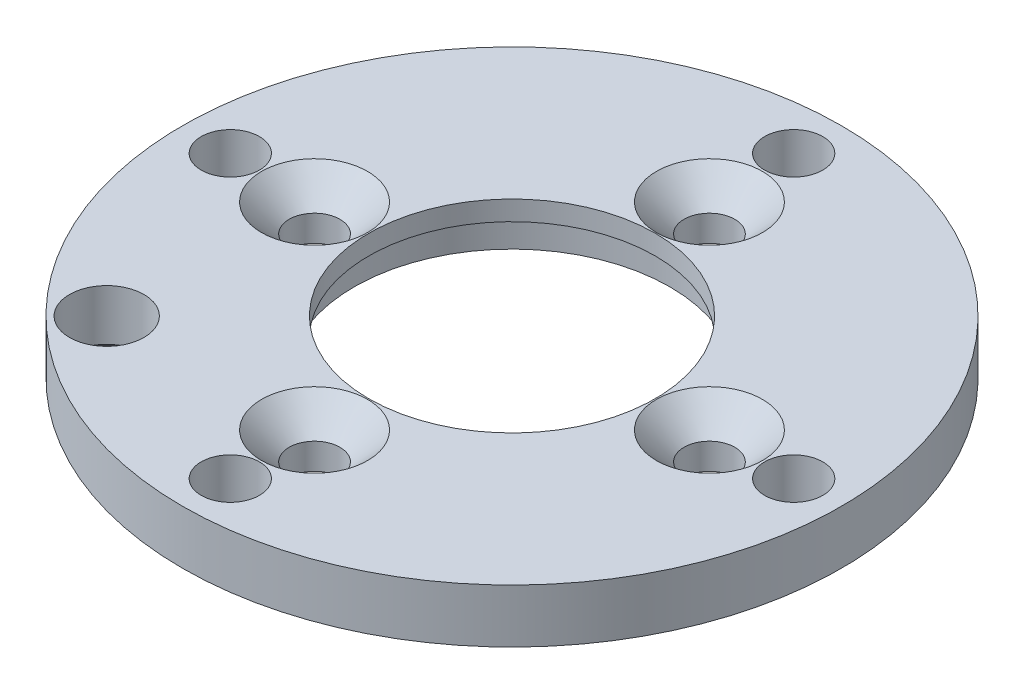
ISO-10303-21;
HEADER;
FILE_DESCRIPTION(('STEP AP214'),'2;1');
FILE_NAME('part.step','',(''),(''),'','','');
FILE_SCHEMA(('AUTOMOTIVE_DESIGN { 1 0 10303 214 1 1 1 1 }'));
ENDSEC;
DATA;
#1=APPLICATION_CONTEXT('core data for automotive mechanical design processes');
#2=APPLICATION_PROTOCOL_DEFINITION('international standard','automotive_design',2000,#1);
#3=PRODUCT_CONTEXT('',#1,'mechanical');
#4=PRODUCT('Part','Part','',(#3));
#5=PRODUCT_RELATED_PRODUCT_CATEGORY('part','',(#4));
#6=PRODUCT_DEFINITION_FORMATION('','',#4);
#7=PRODUCT_DEFINITION_CONTEXT('part definition',#1,'design');
#8=PRODUCT_DEFINITION('design','',#6,#7);
#9=PRODUCT_DEFINITION_SHAPE('','',#8);
#10=(LENGTH_UNIT() NAMED_UNIT(*) SI_UNIT(.MILLI.,.METRE.));
#11=(NAMED_UNIT(*) PLANE_ANGLE_UNIT() SI_UNIT($,.RADIAN.));
#12=(NAMED_UNIT(*) SI_UNIT($,.STERADIAN.) SOLID_ANGLE_UNIT());
#13=UNCERTAINTY_MEASURE_WITH_UNIT(LENGTH_MEASURE(1.E-05),#10,'distance_accuracy_value','');
#14=(GEOMETRIC_REPRESENTATION_CONTEXT(3) GLOBAL_UNCERTAINTY_ASSIGNED_CONTEXT((#13)) GLOBAL_UNIT_ASSIGNED_CONTEXT((#10,
#11,#12)) REPRESENTATION_CONTEXT('',''));
#15=CARTESIAN_POINT('',(0.,0.,0.));
#16=DIRECTION('',(0.,0.,1.));
#17=DIRECTION('',(1.,0.,0.));
#18=AXIS2_PLACEMENT_3D('',#15,#16,#17);
#19=CARTESIAN_POINT('',(0.,4.7625,0.));
#20=DIRECTION('',(0.,-1.,0.));
#21=DIRECTION('',(0.,0.,-1.));
#22=AXIS2_PLACEMENT_3D('',#19,#20,#21);
#23=CYLINDRICAL_SURFACE('',#22,29.21);
#24=CARTESIAN_POINT('',(0.,4.7625,0.));
#25=DIRECTION('',(0.,1.,0.));
#26=DIRECTION('',(0.,0.,1.));
#27=AXIS2_PLACEMENT_3D('',#24,#25,#26);
#28=CIRCLE('',#27,29.21);
#29=CARTESIAN_POINT('',(0.,4.7625,-29.21));
#30=VERTEX_POINT('',#29);
#31=EDGE_CURVE('E44',#30,#30,#28,.T.);
#32=CARTESIAN_POINT('',(0.,0.,0.));
#33=DIRECTION('',(0.,1.,0.));
#34=DIRECTION('',(0.,0.,1.));
#35=AXIS2_PLACEMENT_3D('',#32,#33,#34);
#36=CIRCLE('',#35,29.21);
#37=CARTESIAN_POINT('',(0.,0.,-29.21));
#38=VERTEX_POINT('',#37);
#39=EDGE_CURVE('E48',#38,#38,#36,.T.);
#40=CARTESIAN_POINT('',(0.,4.7625,-29.21));
#41=CARTESIAN_POINT('',(0.,4.712890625,-29.21));
#42=CARTESIAN_POINT('',(0.,4.66328125,-29.21));
#43=CARTESIAN_POINT('',(0.,4.5640625,-29.21));
#44=CARTESIAN_POINT('',(0.,4.514453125,-29.21));
#45=CARTESIAN_POINT('',(0.,4.415234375,-29.21));
#46=CARTESIAN_POINT('',(0.,4.365625,-29.21));
#47=CARTESIAN_POINT('',(0.,4.26640625,-29.21));
#48=CARTESIAN_POINT('',(0.,4.216796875,-29.21));
#49=CARTESIAN_POINT('',(0.,4.117578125,-29.21));
#50=CARTESIAN_POINT('',(0.,4.06796875,-29.21));
#51=CARTESIAN_POINT('',(0.,3.96875,-29.21));
#52=CARTESIAN_POINT('',(0.,3.919140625,-29.21));
#53=CARTESIAN_POINT('',(0.,3.819921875,-29.21));
#54=CARTESIAN_POINT('',(0.,3.7703125,-29.21));
#55=CARTESIAN_POINT('',(0.,3.67109375,-29.21));
#56=CARTESIAN_POINT('',(0.,3.621484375,-29.21));
#57=CARTESIAN_POINT('',(0.,3.522265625,-29.21));
#58=CARTESIAN_POINT('',(0.,3.47265625,-29.21));
#59=CARTESIAN_POINT('',(0.,3.3734375,-29.21));
#60=CARTESIAN_POINT('',(0.,3.323828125,-29.21));
#61=CARTESIAN_POINT('',(0.,3.224609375,-29.21));
#62=CARTESIAN_POINT('',(0.,3.175,-29.21));
#63=CARTESIAN_POINT('',(0.,3.07578125,-29.21));
#64=CARTESIAN_POINT('',(0.,3.026171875,-29.21));
#65=CARTESIAN_POINT('',(0.,2.926953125,-29.21));
#66=CARTESIAN_POINT('',(0.,2.87734375,-29.21));
#67=CARTESIAN_POINT('',(0.,2.778125,-29.21));
#68=CARTESIAN_POINT('',(0.,2.728515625,-29.21));
#69=CARTESIAN_POINT('',(0.,2.629296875,-29.21));
#70=CARTESIAN_POINT('',(0.,2.5796875,-29.21));
#71=CARTESIAN_POINT('',(0.,2.48046875,-29.21));
#72=CARTESIAN_POINT('',(0.,2.430859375,-29.21));
#73=CARTESIAN_POINT('',(0.,2.331640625,-29.21));
#74=CARTESIAN_POINT('',(0.,2.28203125,-29.21));
#75=CARTESIAN_POINT('',(0.,2.1828125,-29.21));
#76=CARTESIAN_POINT('',(0.,2.133203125,-29.21));
#77=CARTESIAN_POINT('',(0.,2.033984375,-29.21));
#78=CARTESIAN_POINT('',(0.,1.984375,-29.21));
#79=CARTESIAN_POINT('',(0.,1.88515625,-29.21));
#80=CARTESIAN_POINT('',(0.,1.835546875,-29.21));
#81=CARTESIAN_POINT('',(0.,1.736328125,-29.21));
#82=CARTESIAN_POINT('',(0.,1.68671875,-29.21));
#83=CARTESIAN_POINT('',(0.,1.5875,-29.21));
#84=CARTESIAN_POINT('',(0.,1.537890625,-29.21));
#85=CARTESIAN_POINT('',(0.,1.438671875,-29.21));
#86=CARTESIAN_POINT('',(0.,1.3890625,-29.21));
#87=CARTESIAN_POINT('',(0.,1.28984375,-29.21));
#88=CARTESIAN_POINT('',(0.,1.240234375,-29.21));
#89=CARTESIAN_POINT('',(0.,1.141015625,-29.21));
#90=CARTESIAN_POINT('',(0.,1.09140625,-29.21));
#91=CARTESIAN_POINT('',(0.,0.9921875,-29.21));
#92=CARTESIAN_POINT('',(0.,0.942578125,-29.21));
#93=CARTESIAN_POINT('',(0.,0.843359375,-29.21));
#94=CARTESIAN_POINT('',(0.,0.79375,-29.21));
#95=CARTESIAN_POINT('',(0.,0.69453125,-29.21));
#96=CARTESIAN_POINT('',(0.,0.644921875,-29.21));
#97=CARTESIAN_POINT('',(0.,0.545703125,-29.21));
#98=CARTESIAN_POINT('',(0.,0.49609375,-29.21));
#99=CARTESIAN_POINT('',(0.,0.396875,-29.21));
#100=CARTESIAN_POINT('',(0.,0.347265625,-29.21));
#101=CARTESIAN_POINT('',(0.,0.248046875,-29.21));
#102=CARTESIAN_POINT('',(0.,0.1984375,-29.21));
#103=CARTESIAN_POINT('',(0.,0.09921875,-29.21));
#104=CARTESIAN_POINT('',(0.,0.049609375,-29.21));
#105=CARTESIAN_POINT('',(0.,0.,-29.21));
#106=B_SPLINE_CURVE_WITH_KNOTS('',3,(#40,#41,#42,#43,#44,#45,#46,#47,#48,#49,#50,#51,#52,#53,
#54,#55,#56,#57,#58,#59,#60,#61,#62,#63,#64,#65,#66,#67,#68,#69,#70,#71,#72,#73,#74,#75,#76,#77,
#78,#79,#80,#81,#82,#83,#84,#85,#86,#87,#88,#89,#90,#91,#92,#93,#94,#95,#96,#97,#98,#99,#100,
#101,#102,#103,#104,#105),.UNSPECIFIED.,.F.,.F.,(4,2,2,2,2,2,2,2,2,2,2,2,2,2,2,2,2,2,2,2,2,2,2,
2,2,2,2,2,2,2,2,2,4),(0.,0.148828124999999,0.297656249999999,0.446484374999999,
0.595312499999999,0.744140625,0.89296875,1.041796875,1.190625,1.339453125,1.48828125,
1.637109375,1.7859375,1.934765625,2.08359375,2.232421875,2.38125,2.530078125,2.67890625,
2.827734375,2.9765625,3.125390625,3.27421875,3.423046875,3.571875,3.720703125,3.86953125,
4.018359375,4.1671875,4.316015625,4.46484375,4.613671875,4.7625),.UNSPECIFIED.);
#107=EDGE_CURVE('BSEAM34',#30,#38,#106,.T.);
#108=ORIENTED_EDGE('',*,*,#31,.F.);
#109=ORIENTED_EDGE('',*,*,#39,.T.);
#110=ORIENTED_EDGE('',*,*,#107,.T.);
#111=ORIENTED_EDGE('',*,*,#107,.F.);
#112=EDGE_LOOP('',(#108,#110,#109,#111));
#113=FACE_BOUND('',#112,.T.);
#114=ADVANCED_FACE('F34',(#113),#23,.T.);
#115=CARTESIAN_POINT('',(0.,4.7625,0.));
#116=DIRECTION('',(0.,1.,0.));
#117=DIRECTION('',(0.,0.,1.));
#118=AXIS2_PLACEMENT_3D('',#115,#116,#117);
#119=PLANE('',#118);
#120=CARTESIAN_POINT('',(-17.9605122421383,4.7625,17.9605122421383));
#121=DIRECTION('',(0.,1.,0.));
#122=DIRECTION('',(0.,0.,1.));
#123=AXIS2_PLACEMENT_3D('',#120,#121,#122);
#124=CIRCLE('',#123,3.302);
#125=CARTESIAN_POINT('',(-17.9605122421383,4.7625,21.2625122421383));
#126=VERTEX_POINT('',#125);
#127=EDGE_CURVE('E125',#126,#126,#124,.T.);
#128=ORIENTED_EDGE('',*,*,#127,.F.);
#129=EDGE_LOOP('',(#128));
#130=FACE_BOUND('',#129,.T.);
#131=CARTESIAN_POINT('',(-17.5006,4.7625,1.83309161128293E-13));
#132=DIRECTION('',(0.,1.,0.));
#133=DIRECTION('',(0.,0.,1.));
#134=AXIS2_PLACEMENT_3D('',#131,#132,#133);
#135=CIRCLE('',#134,4.7);
#136=CARTESIAN_POINT('',(-17.5006,4.7625,4.70000000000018));
#137=VERTEX_POINT('',#136);
#138=EDGE_CURVE('E116',#137,#137,#135,.T.);
#139=ORIENTED_EDGE('',*,*,#138,.F.);
#140=EDGE_LOOP('',(#139));
#141=FACE_BOUND('',#140,.T.);
#142=CARTESIAN_POINT('',(-1.22206107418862E-13,4.7625,-17.5006));
#143=DIRECTION('',(0.,1.,0.));
#144=DIRECTION('',(0.,0.,1.));
#145=AXIS2_PLACEMENT_3D('',#142,#143,#144);
#146=CIRCLE('',#145,4.7);
#147=CARTESIAN_POINT('',(-1.22206107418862E-13,4.7625,-12.8006));
#148=VERTEX_POINT('',#147);
#149=EDGE_CURVE('E107',#148,#148,#146,.T.);
#150=ORIENTED_EDGE('',*,*,#149,.F.);
#151=EDGE_LOOP('',(#150));
#152=FACE_BOUND('',#151,.T.);
#153=CARTESIAN_POINT('',(17.5006,4.7625,0.));
#154=DIRECTION('',(0.,1.,0.));
#155=DIRECTION('',(0.,0.,1.));
#156=AXIS2_PLACEMENT_3D('',#153,#154,#155);
#157=CIRCLE('',#156,4.7);
#158=CARTESIAN_POINT('',(17.5006,4.7625,4.69999999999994));
#159=VERTEX_POINT('',#158);
#160=EDGE_CURVE('E98',#159,#159,#157,.T.);
#161=ORIENTED_EDGE('',*,*,#160,.F.);
#162=EDGE_LOOP('',(#161));
#163=FACE_BOUND('',#162,.T.);
#164=CARTESIAN_POINT('',(-24.9682,4.7625,2.61528164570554E-13));
#165=DIRECTION('',(0.,1.,0.));
#166=DIRECTION('',(0.,0.,1.));
#167=AXIS2_PLACEMENT_3D('',#164,#165,#166);
#168=CIRCLE('',#167,2.57975099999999);
#169=CARTESIAN_POINT('',(-24.9682,4.7625,2.57975100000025));
#170=VERTEX_POINT('',#169);
#171=EDGE_CURVE('E95',#170,#170,#168,.T.);
#172=ORIENTED_EDGE('',*,*,#171,.F.);
#173=EDGE_LOOP('',(#172));
#174=FACE_BOUND('',#173,.T.);
#175=CARTESIAN_POINT('',(-1.74352109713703E-13,4.7625,-24.9682));
#176=DIRECTION('',(0.,1.,0.));
#177=DIRECTION('',(0.,0.,1.));
#178=AXIS2_PLACEMENT_3D('',#175,#176,#177);
#179=CIRCLE('',#178,2.57975099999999);
#180=CARTESIAN_POINT('',(-1.74352109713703E-13,4.7625,-22.388449));
#181=VERTEX_POINT('',#180);
#182=EDGE_CURVE('E89',#181,#181,#179,.T.);
#183=ORIENTED_EDGE('',*,*,#182,.F.);
#184=EDGE_LOOP('',(#183));
#185=FACE_BOUND('',#184,.T.);
#186=CARTESIAN_POINT('',(24.9682,4.7625,0.));
#187=DIRECTION('',(0.,1.,0.));
#188=DIRECTION('',(0.,0.,1.));
#189=AXIS2_PLACEMENT_3D('',#186,#187,#188);
#190=CIRCLE('',#189,2.57975099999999);
#191=CARTESIAN_POINT('',(24.9682,4.7625,2.5797509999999));
#192=VERTEX_POINT('',#191);
#193=EDGE_CURVE('E83',#192,#192,#190,.T.);
#194=ORIENTED_EDGE('',*,*,#193,.F.);
#195=EDGE_LOOP('',(#194));
#196=FACE_BOUND('',#195,.T.);
#197=CARTESIAN_POINT('',(0.,4.7625,0.));
#198=DIRECTION('',(0.,1.,0.));
#199=DIRECTION('',(0.,0.,1.));
#200=AXIS2_PLACEMENT_3D('',#197,#198,#199);
#201=CIRCLE('',#200,12.7);
#202=CARTESIAN_POINT('',(0.,4.7625,12.7));
#203=VERTEX_POINT('',#202);
#204=EDGE_CURVE('E54',#203,#203,#201,.T.);
#205=ORIENTED_EDGE('',*,*,#204,.F.);
#206=EDGE_LOOP('',(#205));
#207=FACE_BOUND('',#206,.T.);
#208=CARTESIAN_POINT('',(0.,4.7625,17.5006));
#209=DIRECTION('',(0.,1.,0.));
#210=DIRECTION('',(0.,0.,1.));
#211=AXIS2_PLACEMENT_3D('',#208,#209,#210);
#212=CIRCLE('',#211,4.7);
#213=CARTESIAN_POINT('',(0.,4.7625,22.2006));
#214=VERTEX_POINT('',#213);
#215=EDGE_CURVE('E64',#214,#214,#212,.T.);
#216=ORIENTED_EDGE('',*,*,#215,.F.);
#217=EDGE_LOOP('',(#216));
#218=FACE_BOUND('',#217,.T.);
#219=CARTESIAN_POINT('',(0.,4.7625,24.9682));
#220=DIRECTION('',(0.,1.,0.));
#221=DIRECTION('',(0.,0.,1.));
#222=AXIS2_PLACEMENT_3D('',#219,#220,#221);
#223=CIRCLE('',#222,2.57975099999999);
#224=CARTESIAN_POINT('',(0.,4.7625,27.547951));
#225=VERTEX_POINT('',#224);
#226=EDGE_CURVE('E61',#225,#225,#223,.T.);
#227=ORIENTED_EDGE('',*,*,#226,.F.);
#228=EDGE_LOOP('',(#227));
#229=FACE_BOUND('',#228,.T.);
#230=ORIENTED_EDGE('',*,*,#31,.T.);
#231=EDGE_LOOP('',(#230));
#232=FACE_BOUND('',#231,.T.);
#233=ADVANCED_FACE('F131',(#130,#141,#152,#163,#174,#185,#196,#207,#218,#229,#232),#119,.T.);
#234=CARTESIAN_POINT('',(0.,0.,0.));
#235=DIRECTION('',(0.,1.,0.));
#236=DIRECTION('',(0.,0.,1.));
#237=AXIS2_PLACEMENT_3D('',#234,#235,#236);
#238=PLANE('',#237);
#239=CARTESIAN_POINT('',(-17.9605122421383,0.,17.9605122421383));
#240=DIRECTION('',(0.,1.,0.));
#241=DIRECTION('',(0.,0.,1.));
#242=AXIS2_PLACEMENT_3D('',#239,#240,#241);
#243=CIRCLE('',#242,3.55599999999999);
#244=CARTESIAN_POINT('',(-17.9605122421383,0.,21.5165122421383));
#245=VERTEX_POINT('',#244);
#246=EDGE_CURVE('E40',#245,#245,#243,.T.);
#247=ORIENTED_EDGE('',*,*,#246,.T.);
#248=EDGE_LOOP('',(#247));
#249=FACE_BOUND('',#248,.T.);
#250=CARTESIAN_POINT('',(-17.5006,0.,1.83309161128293E-13));
#251=DIRECTION('',(0.,1.,0.));
#252=DIRECTION('',(0.,0.,1.));
#253=AXIS2_PLACEMENT_3D('',#250,#251,#252);
#254=CIRCLE('',#253,2.25);
#255=CARTESIAN_POINT('',(-17.5006,0.,2.25000000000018));
#256=VERTEX_POINT('',#255);
#257=EDGE_CURVE('E122',#256,#256,#254,.T.);
#258=ORIENTED_EDGE('',*,*,#257,.T.);
#259=EDGE_LOOP('',(#258));
#260=FACE_BOUND('',#259,.T.);
#261=CARTESIAN_POINT('',(-1.22206107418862E-13,0.,-17.5006));
#262=DIRECTION('',(0.,1.,0.));
#263=DIRECTION('',(0.,0.,1.));
#264=AXIS2_PLACEMENT_3D('',#261,#262,#263);
#265=CIRCLE('',#264,2.25);
#266=CARTESIAN_POINT('',(-1.22206107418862E-13,0.,-15.2506));
#267=VERTEX_POINT('',#266);
#268=EDGE_CURVE('E113',#267,#267,#265,.T.);
#269=ORIENTED_EDGE('',*,*,#268,.T.);
#270=EDGE_LOOP('',(#269));
#271=FACE_BOUND('',#270,.T.);
#272=CARTESIAN_POINT('',(17.5006,0.,0.));
#273=DIRECTION('',(0.,1.,0.));
#274=DIRECTION('',(0.,0.,1.));
#275=AXIS2_PLACEMENT_3D('',#272,#273,#274);
#276=CIRCLE('',#275,2.25);
#277=CARTESIAN_POINT('',(17.5006,0.,2.24999999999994));
#278=VERTEX_POINT('',#277);
#279=EDGE_CURVE('E104',#278,#278,#276,.T.);
#280=ORIENTED_EDGE('',*,*,#279,.T.);
#281=EDGE_LOOP('',(#280));
#282=FACE_BOUND('',#281,.T.);
#283=CARTESIAN_POINT('',(-24.9682,0.,2.61528164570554E-13));
#284=DIRECTION('',(0.,1.,0.));
#285=DIRECTION('',(0.,0.,1.));
#286=AXIS2_PLACEMENT_3D('',#283,#284,#285);
#287=CIRCLE('',#286,2.57975099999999);
#288=CARTESIAN_POINT('',(-24.9682,0.,2.57975100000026));
#289=VERTEX_POINT('',#288);
#290=EDGE_CURVE('E92',#289,#289,#287,.T.);
#291=ORIENTED_EDGE('',*,*,#290,.T.);
#292=EDGE_LOOP('',(#291));
#293=FACE_BOUND('',#292,.T.);
#294=CARTESIAN_POINT('',(-1.74352109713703E-13,0.,-24.9682));
#295=DIRECTION('',(0.,1.,0.));
#296=DIRECTION('',(0.,0.,1.));
#297=AXIS2_PLACEMENT_3D('',#294,#295,#296);
#298=CIRCLE('',#297,2.579751);
#299=CARTESIAN_POINT('',(-1.74352109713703E-13,0.,-22.388449));
#300=VERTEX_POINT('',#299);
#301=EDGE_CURVE('E86',#300,#300,#298,.T.);
#302=ORIENTED_EDGE('',*,*,#301,.T.);
#303=EDGE_LOOP('',(#302));
#304=FACE_BOUND('',#303,.T.);
#305=CARTESIAN_POINT('',(24.9682,0.,0.));
#306=DIRECTION('',(0.,1.,0.));
#307=DIRECTION('',(0.,0.,1.));
#308=AXIS2_PLACEMENT_3D('',#305,#306,#307);
#309=CIRCLE('',#308,2.57975099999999);
#310=CARTESIAN_POINT('',(24.9682,0.,2.57975099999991));
#311=VERTEX_POINT('',#310);
#312=EDGE_CURVE('E80',#311,#311,#309,.T.);
#313=ORIENTED_EDGE('',*,*,#312,.T.);
#314=EDGE_LOOP('',(#313));
#315=FACE_BOUND('',#314,.T.);
#316=CARTESIAN_POINT('',(0.,0.,0.));
#317=DIRECTION('',(0.,-1.,0.));
#318=DIRECTION('',(0.,0.,-1.));
#319=AXIS2_PLACEMENT_3D('',#316,#317,#318);
#320=CIRCLE('',#319,13.9954);
#321=CARTESIAN_POINT('',(0.,0.,-13.9954));
#322=VERTEX_POINT('',#321);
#323=EDGE_CURVE('E53',#322,#322,#320,.T.);
#324=ORIENTED_EDGE('',*,*,#323,.F.);
#325=EDGE_LOOP('',(#324));
#326=FACE_BOUND('',#325,.T.);
#327=CARTESIAN_POINT('',(0.,0.,17.5006));
#328=DIRECTION('',(0.,1.,0.));
#329=DIRECTION('',(0.,0.,1.));
#330=AXIS2_PLACEMENT_3D('',#327,#328,#329);
#331=CIRCLE('',#330,2.25);
#332=CARTESIAN_POINT('',(0.,0.,19.7506));
#333=VERTEX_POINT('',#332);
#334=EDGE_CURVE('E70',#333,#333,#331,.T.);
#335=ORIENTED_EDGE('',*,*,#334,.T.);
#336=EDGE_LOOP('',(#335));
#337=FACE_BOUND('',#336,.T.);
#338=CARTESIAN_POINT('',(0.,0.,24.9682));
#339=DIRECTION('',(0.,1.,0.));
#340=DIRECTION('',(0.,0.,1.));
#341=AXIS2_PLACEMENT_3D('',#338,#339,#340);
#342=CIRCLE('',#341,2.579751);
#343=CARTESIAN_POINT('',(0.,0.,27.547951));
#344=VERTEX_POINT('',#343);
#345=EDGE_CURVE('E58',#344,#344,#342,.T.);
#346=ORIENTED_EDGE('',*,*,#345,.T.);
#347=EDGE_LOOP('',(#346));
#348=FACE_BOUND('',#347,.T.);
#349=ORIENTED_EDGE('',*,*,#39,.F.);
#350=EDGE_LOOP('',(#349));
#351=FACE_BOUND('',#350,.T.);
#352=ADVANCED_FACE('F134',(#249,#260,#271,#282,#293,#304,#315,#326,#337,#348,#351),#238,.F.);
#353=CARTESIAN_POINT('',(0.,4.7625,24.9682));
#354=DIRECTION('',(0.,1.,0.));
#355=DIRECTION('',(0.,0.,1.));
#356=AXIS2_PLACEMENT_3D('',#353,#354,#355);
#357=CYLINDRICAL_SURFACE('',#356,2.57975099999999);
#358=ORIENTED_EDGE('',*,*,#345,.F.);
#359=EDGE_LOOP('',(#358));
#360=FACE_BOUND('',#359,.T.);
#361=ORIENTED_EDGE('',*,*,#226,.T.);
#362=EDGE_LOOP('',(#361));
#363=FACE_BOUND('',#362,.T.);
#364=ADVANCED_FACE('F160',(#360,#363),#357,.F.);
#365=CARTESIAN_POINT('',(0.,4.7625,17.5006));
#366=DIRECTION('',(0.,1.,0.));
#367=DIRECTION('',(0.,0.,1.));
#368=AXIS2_PLACEMENT_3D('',#365,#366,#367);
#369=CONICAL_SURFACE('',#368,4.7,0.785398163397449);
#370=CARTESIAN_POINT('',(0.,2.3125,17.5006));
#371=DIRECTION('',(0.,1.,0.));
#372=DIRECTION('',(0.,0.,1.));
#373=AXIS2_PLACEMENT_3D('',#370,#371,#372);
#374=CIRCLE('',#373,2.25);
#375=CARTESIAN_POINT('',(0.,2.3125,19.7506));
#376=VERTEX_POINT('',#375);
#377=EDGE_CURVE('E67',#376,#376,#374,.T.);
#378=ORIENTED_EDGE('',*,*,#377,.F.);
#379=EDGE_LOOP('',(#378));
#380=FACE_BOUND('',#379,.T.);
#381=ORIENTED_EDGE('',*,*,#215,.T.);
#382=EDGE_LOOP('',(#381));
#383=FACE_BOUND('',#382,.T.);
#384=ADVANCED_FACE('F165',(#380,#383),#369,.F.);
#385=CARTESIAN_POINT('',(0.,4.7625,17.5006));
#386=DIRECTION('',(0.,1.,0.));
#387=DIRECTION('',(0.,0.,1.));
#388=AXIS2_PLACEMENT_3D('',#385,#386,#387);
#389=CYLINDRICAL_SURFACE('',#388,2.25);
#390=ORIENTED_EDGE('',*,*,#334,.F.);
#391=EDGE_LOOP('',(#390));
#392=FACE_BOUND('',#391,.T.);
#393=ORIENTED_EDGE('',*,*,#377,.T.);
#394=EDGE_LOOP('',(#393));
#395=FACE_BOUND('',#394,.T.);
#396=ADVANCED_FACE('F172',(#392,#395),#389,.F.);
#397=CARTESIAN_POINT('',(0.,3.0226,0.));
#398=DIRECTION('',(0.,-1.,0.));
#399=DIRECTION('',(0.,0.,-1.));
#400=AXIS2_PLACEMENT_3D('',#397,#398,#399);
#401=CYLINDRICAL_SURFACE('',#400,13.9954);
#402=CARTESIAN_POINT('',(0.,3.0226,0.));
#403=DIRECTION('',(0.,-1.,0.));
#404=DIRECTION('',(0.,0.,-1.));
#405=AXIS2_PLACEMENT_3D('',#402,#403,#404);
#406=CIRCLE('',#405,13.9954);
#407=CARTESIAN_POINT('',(0.,3.0226,-13.9954));
#408=VERTEX_POINT('',#407);
#409=EDGE_CURVE('E73',#408,#408,#406,.T.);
#410=ORIENTED_EDGE('',*,*,#409,.F.);
#411=EDGE_LOOP('',(#410));
#412=FACE_BOUND('',#411,.T.);
#413=ORIENTED_EDGE('',*,*,#323,.T.);
#414=EDGE_LOOP('',(#413));
#415=FACE_BOUND('',#414,.T.);
#416=ADVANCED_FACE('F176',(#412,#415),#401,.F.);
#417=CARTESIAN_POINT('',(0.,3.0226,0.));
#418=DIRECTION('',(0.,-1.,0.));
#419=DIRECTION('',(0.,0.,-1.));
#420=AXIS2_PLACEMENT_3D('',#417,#418,#419);
#421=PLANE('',#420);
#422=CARTESIAN_POINT('',(0.,3.0226,0.));
#423=DIRECTION('',(0.,-1.,0.));
#424=DIRECTION('',(0.,0.,-1.));
#425=AXIS2_PLACEMENT_3D('',#422,#423,#424);
#426=CIRCLE('',#425,12.7);
#427=CARTESIAN_POINT('',(0.,3.0226,12.7));
#428=VERTEX_POINT('',#427);
#429=EDGE_CURVE('E51',#428,#428,#426,.T.);
#430=ORIENTED_EDGE('',*,*,#429,.F.);
#431=EDGE_LOOP('',(#430));
#432=FACE_BOUND('',#431,.T.);
#433=ORIENTED_EDGE('',*,*,#409,.T.);
#434=EDGE_LOOP('',(#433));
#435=FACE_BOUND('',#434,.T.);
#436=ADVANCED_FACE('F180',(#432,#435),#421,.T.);
#437=CARTESIAN_POINT('',(0.,0.952500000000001,0.));
#438=DIRECTION('',(0.,1.,0.));
#439=DIRECTION('',(0.,0.,1.));
#440=AXIS2_PLACEMENT_3D('',#437,#438,#439);
#441=CYLINDRICAL_SURFACE('',#440,12.7);
#442=CARTESIAN_POINT('',(0.,3.0226,12.7));
#443=CARTESIAN_POINT('',(0.,3.04072395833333,12.7));
#444=CARTESIAN_POINT('',(0.,3.05884791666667,12.7));
#445=CARTESIAN_POINT('',(0.,3.09509583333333,12.7));
#446=CARTESIAN_POINT('',(0.,3.11321979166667,12.7));
#447=CARTESIAN_POINT('',(0.,3.14946770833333,12.7));
#448=CARTESIAN_POINT('',(0.,3.16759166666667,12.7));
#449=CARTESIAN_POINT('',(0.,3.20383958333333,12.7));
#450=CARTESIAN_POINT('',(0.,3.22196354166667,12.7));
#451=CARTESIAN_POINT('',(0.,3.25821145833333,12.7));
#452=CARTESIAN_POINT('',(0.,3.27633541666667,12.7));
#453=CARTESIAN_POINT('',(0.,3.31258333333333,12.7));
#454=CARTESIAN_POINT('',(0.,3.33070729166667,12.7));
#455=CARTESIAN_POINT('',(0.,3.36695520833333,12.7));
#456=CARTESIAN_POINT('',(0.,3.38507916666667,12.7));
#457=CARTESIAN_POINT('',(0.,3.42132708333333,12.7));
#458=CARTESIAN_POINT('',(0.,3.43945104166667,12.7));
#459=CARTESIAN_POINT('',(0.,3.47569895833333,12.7));
#460=CARTESIAN_POINT('',(0.,3.49382291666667,12.7));
#461=CARTESIAN_POINT('',(0.,3.53007083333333,12.7));
#462=CARTESIAN_POINT('',(0.,3.54819479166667,12.7));
#463=CARTESIAN_POINT('',(0.,3.58444270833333,12.7));
#464=CARTESIAN_POINT('',(0.,3.60256666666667,12.7));
#465=CARTESIAN_POINT('',(0.,3.63881458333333,12.7));
#466=CARTESIAN_POINT('',(0.,3.65693854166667,12.7));
#467=CARTESIAN_POINT('',(0.,3.69318645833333,12.7));
#468=CARTESIAN_POINT('',(0.,3.71131041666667,12.7));
#469=CARTESIAN_POINT('',(0.,3.74755833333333,12.7));
#470=CARTESIAN_POINT('',(0.,3.76568229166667,12.7));
#471=CARTESIAN_POINT('',(0.,3.80193020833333,12.7));
#472=CARTESIAN_POINT('',(0.,3.82005416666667,12.7));
#473=CARTESIAN_POINT('',(0.,3.85630208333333,12.7));
#474=CARTESIAN_POINT('',(0.,3.87442604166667,12.7));
#475=CARTESIAN_POINT('',(0.,3.91067395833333,12.7));
#476=CARTESIAN_POINT('',(0.,3.92879791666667,12.7));
#477=CARTESIAN_POINT('',(0.,3.96504583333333,12.7));
#478=CARTESIAN_POINT('',(0.,3.98316979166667,12.7));
#479=CARTESIAN_POINT('',(0.,4.01941770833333,12.7));
#480=CARTESIAN_POINT('',(0.,4.03754166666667,12.7));
#481=CARTESIAN_POINT('',(0.,4.07378958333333,12.7));
#482=CARTESIAN_POINT('',(0.,4.09191354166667,12.7));
#483=CARTESIAN_POINT('',(0.,4.12816145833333,12.7));
#484=CARTESIAN_POINT('',(0.,4.14628541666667,12.7));
#485=CARTESIAN_POINT('',(0.,4.18253333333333,12.7));
#486=CARTESIAN_POINT('',(0.,4.20065729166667,12.7));
#487=CARTESIAN_POINT('',(0.,4.23690520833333,12.7));
#488=CARTESIAN_POINT('',(0.,4.25502916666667,12.7));
#489=CARTESIAN_POINT('',(0.,4.29127708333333,12.7));
#490=CARTESIAN_POINT('',(0.,4.30940104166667,12.7));
#491=CARTESIAN_POINT('',(0.,4.34564895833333,12.7));
#492=CARTESIAN_POINT('',(0.,4.36377291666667,12.7));
#493=CARTESIAN_POINT('',(0.,4.40002083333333,12.7));
#494=CARTESIAN_POINT('',(0.,4.41814479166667,12.7));
#495=CARTESIAN_POINT('',(0.,4.45439270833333,12.7));
#496=CARTESIAN_POINT('',(0.,4.47251666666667,12.7));
#497=CARTESIAN_POINT('',(0.,4.50876458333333,12.7));
#498=CARTESIAN_POINT('',(0.,4.52688854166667,12.7));
#499=CARTESIAN_POINT('',(0.,4.56313645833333,12.7));
#500=CARTESIAN_POINT('',(0.,4.58126041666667,12.7));
#501=CARTESIAN_POINT('',(0.,4.61750833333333,12.7));
#502=CARTESIAN_POINT('',(0.,4.63563229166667,12.7));
#503=CARTESIAN_POINT('',(0.,4.67188020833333,12.7));
#504=CARTESIAN_POINT('',(0.,4.69000416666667,12.7));
#505=CARTESIAN_POINT('',(0.,4.72625208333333,12.7));
#506=CARTESIAN_POINT('',(0.,4.74437604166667,12.7));
#507=CARTESIAN_POINT('',(0.,4.7625,12.7));
#508=B_SPLINE_CURVE_WITH_KNOTS('',3,(#442,#443,#444,#445,#446,#447,#448,#449,#450,#451,#452,
#453,#454,#455,#456,#457,#458,#459,#460,#461,#462,#463,#464,#465,#466,#467,#468,#469,#470,#471,
#472,#473,#474,#475,#476,#477,#478,#479,#480,#481,#482,#483,#484,#485,#486,#487,#488,#489,#490,
#491,#492,#493,#494,#495,#496,#497,#498,#499,#500,#501,#502,#503,#504,#505,#506,#507),
.UNSPECIFIED.,.F.,.F.,(4,2,2,2,2,2,2,2,2,2,2,2,2,2,2,2,2,2,2,2,2,2,2,2,2,2,2,2,2,2,2,2,4),(0.,
0.0543718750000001,0.10874375,0.163115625,0.2174875,0.271859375,0.32623125,0.380603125,0.434975,
0.489346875,0.54371875,0.598090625,0.6524625,0.706834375,0.76120625,0.815578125,0.86995,
0.924321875,0.97869375,1.033065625,1.0874375,1.141809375,1.19618125,1.250553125,1.304925,
1.359296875,1.41366875,1.468040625,1.5224125,1.576784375,1.63115625,1.685528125,1.7399),.UNSPECIFIED.);
#509=EDGE_CURVE('BSEAM184',#428,#203,#508,.T.);
#510=ORIENTED_EDGE('',*,*,#429,.T.);
#511=ORIENTED_EDGE('',*,*,#204,.T.);
#512=ORIENTED_EDGE('',*,*,#509,.T.);
#513=ORIENTED_EDGE('',*,*,#509,.F.);
#514=EDGE_LOOP('',(#510,#512,#511,#513));
#515=FACE_BOUND('',#514,.T.);
#516=ADVANCED_FACE('F184',(#515),#441,.F.);
#517=CARTESIAN_POINT('',(24.9682,4.7625,0.));
#518=DIRECTION('',(0.,1.,0.));
#519=DIRECTION('',(0.,0.,1.));
#520=AXIS2_PLACEMENT_3D('',#517,#518,#519);
#521=CYLINDRICAL_SURFACE('',#520,2.57975099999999);
#522=ORIENTED_EDGE('',*,*,#312,.F.);
#523=EDGE_LOOP('',(#522));
#524=FACE_BOUND('',#523,.T.);
#525=ORIENTED_EDGE('',*,*,#193,.T.);
#526=EDGE_LOOP('',(#525));
#527=FACE_BOUND('',#526,.T.);
#528=ADVANCED_FACE('F188',(#524,#527),#521,.F.);
#529=CARTESIAN_POINT('',(-1.74352109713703E-13,4.7625,-24.9682));
#530=DIRECTION('',(0.,1.,0.));
#531=DIRECTION('',(0.,0.,1.));
#532=AXIS2_PLACEMENT_3D('',#529,#530,#531);
#533=CYLINDRICAL_SURFACE('',#532,2.57975099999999);
#534=ORIENTED_EDGE('',*,*,#301,.F.);
#535=EDGE_LOOP('',(#534));
#536=FACE_BOUND('',#535,.T.);
#537=ORIENTED_EDGE('',*,*,#182,.T.);
#538=EDGE_LOOP('',(#537));
#539=FACE_BOUND('',#538,.T.);
#540=ADVANCED_FACE('F192',(#536,#539),#533,.F.);
#541=CARTESIAN_POINT('',(-24.9682,4.7625,2.61528164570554E-13));
#542=DIRECTION('',(0.,1.,0.));
#543=DIRECTION('',(0.,0.,1.));
#544=AXIS2_PLACEMENT_3D('',#541,#542,#543);
#545=CYLINDRICAL_SURFACE('',#544,2.57975099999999);
#546=ORIENTED_EDGE('',*,*,#290,.F.);
#547=EDGE_LOOP('',(#546));
#548=FACE_BOUND('',#547,.T.);
#549=ORIENTED_EDGE('',*,*,#171,.T.);
#550=EDGE_LOOP('',(#549));
#551=FACE_BOUND('',#550,.T.);
#552=ADVANCED_FACE('F196',(#548,#551),#545,.F.);
#553=CARTESIAN_POINT('',(17.5006,4.7625,0.));
#554=DIRECTION('',(0.,1.,0.));
#555=DIRECTION('',(0.,0.,1.));
#556=AXIS2_PLACEMENT_3D('',#553,#554,#555);
#557=CONICAL_SURFACE('',#556,4.7,0.785398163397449);
#558=CARTESIAN_POINT('',(17.5006,2.3125,0.));
#559=DIRECTION('',(0.,1.,0.));
#560=DIRECTION('',(0.,0.,1.));
#561=AXIS2_PLACEMENT_3D('',#558,#559,#560);
#562=CIRCLE('',#561,2.25);
#563=CARTESIAN_POINT('',(17.5006,2.3125,2.24999999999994));
#564=VERTEX_POINT('',#563);
#565=EDGE_CURVE('E101',#564,#564,#562,.T.);
#566=ORIENTED_EDGE('',*,*,#565,.F.);
#567=EDGE_LOOP('',(#566));
#568=FACE_BOUND('',#567,.T.);
#569=ORIENTED_EDGE('',*,*,#160,.T.);
#570=EDGE_LOOP('',(#569));
#571=FACE_BOUND('',#570,.T.);
#572=ADVANCED_FACE('F200',(#568,#571),#557,.F.);
#573=CARTESIAN_POINT('',(17.5006,4.7625,0.));
#574=DIRECTION('',(0.,1.,0.));
#575=DIRECTION('',(0.,0.,1.));
#576=AXIS2_PLACEMENT_3D('',#573,#574,#575);
#577=CYLINDRICAL_SURFACE('',#576,2.25);
#578=ORIENTED_EDGE('',*,*,#279,.F.);
#579=EDGE_LOOP('',(#578));
#580=FACE_BOUND('',#579,.T.);
#581=ORIENTED_EDGE('',*,*,#565,.T.);
#582=EDGE_LOOP('',(#581));
#583=FACE_BOUND('',#582,.T.);
#584=ADVANCED_FACE('F204',(#580,#583),#577,.F.);
#585=CARTESIAN_POINT('',(-1.22206107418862E-13,4.7625,-17.5006));
#586=DIRECTION('',(0.,1.,0.));
#587=DIRECTION('',(0.,0.,1.));
#588=AXIS2_PLACEMENT_3D('',#585,#586,#587);
#589=CONICAL_SURFACE('',#588,4.7,0.785398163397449);
#590=CARTESIAN_POINT('',(-1.22206107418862E-13,2.3125,-17.5006));
#591=DIRECTION('',(0.,1.,0.));
#592=DIRECTION('',(0.,0.,1.));
#593=AXIS2_PLACEMENT_3D('',#590,#591,#592);
#594=CIRCLE('',#593,2.25);
#595=CARTESIAN_POINT('',(-1.22206107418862E-13,2.3125,-15.2506));
#596=VERTEX_POINT('',#595);
#597=EDGE_CURVE('E110',#596,#596,#594,.T.);
#598=ORIENTED_EDGE('',*,*,#597,.F.);
#599=EDGE_LOOP('',(#598));
#600=FACE_BOUND('',#599,.T.);
#601=ORIENTED_EDGE('',*,*,#149,.T.);
#602=EDGE_LOOP('',(#601));
#603=FACE_BOUND('',#602,.T.);
#604=ADVANCED_FACE('F208',(#600,#603),#589,.F.);
#605=CARTESIAN_POINT('',(-1.22206107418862E-13,4.7625,-17.5006));
#606=DIRECTION('',(0.,1.,0.));
#607=DIRECTION('',(0.,0.,1.));
#608=AXIS2_PLACEMENT_3D('',#605,#606,#607);
#609=CYLINDRICAL_SURFACE('',#608,2.25);
#610=ORIENTED_EDGE('',*,*,#268,.F.);
#611=EDGE_LOOP('',(#610));
#612=FACE_BOUND('',#611,.T.);
#613=ORIENTED_EDGE('',*,*,#597,.T.);
#614=EDGE_LOOP('',(#613));
#615=FACE_BOUND('',#614,.T.);
#616=ADVANCED_FACE('F212',(#612,#615),#609,.F.);
#617=CARTESIAN_POINT('',(-17.5006,4.7625,1.83309161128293E-13));
#618=DIRECTION('',(0.,1.,0.));
#619=DIRECTION('',(0.,0.,1.));
#620=AXIS2_PLACEMENT_3D('',#617,#618,#619);
#621=CONICAL_SURFACE('',#620,4.7,0.785398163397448);
#622=CARTESIAN_POINT('',(-17.5006,2.3125,1.83309161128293E-13));
#623=DIRECTION('',(0.,1.,0.));
#624=DIRECTION('',(0.,0.,1.));
#625=AXIS2_PLACEMENT_3D('',#622,#623,#624);
#626=CIRCLE('',#625,2.25);
#627=CARTESIAN_POINT('',(-17.5006,2.3125,2.25000000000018));
#628=VERTEX_POINT('',#627);
#629=EDGE_CURVE('E119',#628,#628,#626,.T.);
#630=ORIENTED_EDGE('',*,*,#629,.F.);
#631=EDGE_LOOP('',(#630));
#632=FACE_BOUND('',#631,.T.);
#633=ORIENTED_EDGE('',*,*,#138,.T.);
#634=EDGE_LOOP('',(#633));
#635=FACE_BOUND('',#634,.T.);
#636=ADVANCED_FACE('F216',(#632,#635),#621,.F.);
#637=CARTESIAN_POINT('',(-17.5006,4.7625,1.83309161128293E-13));
#638=DIRECTION('',(0.,1.,0.));
#639=DIRECTION('',(0.,0.,1.));
#640=AXIS2_PLACEMENT_3D('',#637,#638,#639);
#641=CYLINDRICAL_SURFACE('',#640,2.25);
#642=ORIENTED_EDGE('',*,*,#257,.F.);
#643=EDGE_LOOP('',(#642));
#644=FACE_BOUND('',#643,.T.);
#645=ORIENTED_EDGE('',*,*,#629,.T.);
#646=EDGE_LOOP('',(#645));
#647=FACE_BOUND('',#646,.T.);
#648=ADVANCED_FACE('F220',(#644,#647),#641,.F.);
#649=CARTESIAN_POINT('',(-17.9605122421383,0.,17.9605122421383));
#650=DIRECTION('',(0.,1.,0.));
#651=DIRECTION('',(0.,0.,1.));
#652=AXIS2_PLACEMENT_3D('',#649,#650,#651);
#653=CYLINDRICAL_SURFACE('',#652,3.302);
#654=CARTESIAN_POINT('',(-17.9605122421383,0.253999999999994,17.9605122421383));
#655=DIRECTION('',(0.,1.,0.));
#656=DIRECTION('',(0.,0.,1.));
#657=AXIS2_PLACEMENT_3D('',#654,#655,#656);
#658=CIRCLE('',#657,3.302);
#659=CARTESIAN_POINT('',(-17.9605122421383,0.253999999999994,21.2625122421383));
#660=VERTEX_POINT('',#659);
#661=EDGE_CURVE('E10',#660,#660,#658,.F.);
#662=ORIENTED_EDGE('',*,*,#661,.T.);
#663=EDGE_LOOP('',(#662));
#664=FACE_BOUND('',#663,.T.);
#665=ORIENTED_EDGE('',*,*,#127,.T.);
#666=EDGE_LOOP('',(#665));
#667=FACE_BOUND('',#666,.T.);
#668=ADVANCED_FACE('F129',(#664,#667),#653,.F.);
#669=CARTESIAN_POINT('',(-17.9605122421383,0.,17.9605122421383));
#670=DIRECTION('',(0.,-1.,0.));
#671=DIRECTION('',(0.,0.,-1.));
#672=AXIS2_PLACEMENT_3D('',#669,#670,#671);
#673=CONICAL_SURFACE('',#672,3.55599999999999,0.785398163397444);
#674=ORIENTED_EDGE('',*,*,#661,.F.);
#675=EDGE_LOOP('',(#674));
#676=FACE_BOUND('',#675,.T.);
#677=ORIENTED_EDGE('',*,*,#246,.F.);
#678=EDGE_LOOP('',(#677));
#679=FACE_BOUND('',#678,.T.);
#680=ADVANCED_FACE('F227',(#676,#679),#673,.F.);
#681=CLOSED_SHELL('',(#114,#233,#352,#364,#384,#396,#416,#436,#516,#528,#540,#552,#572,#584,
#604,#616,#636,#648,#668,#680));
#682=MANIFOLD_SOLID_BREP('B2',#681);
#683=ADVANCED_BREP_SHAPE_REPRESENTATION('',(#18,#682),#14);
#684=SHAPE_DEFINITION_REPRESENTATION(#9,#683);
ENDSEC;
END-ISO-10303-21;
